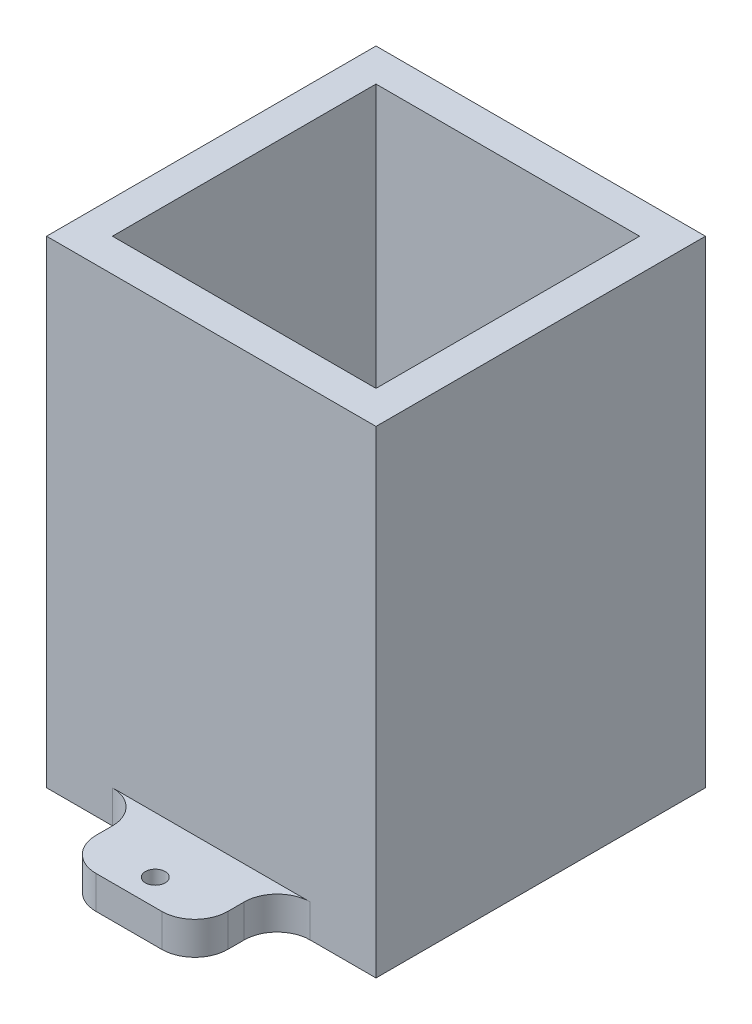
ISO-10303-21;
HEADER;
FILE_DESCRIPTION(('STEP AP214'),'2;1');
FILE_NAME('part.step','',(''),(''),'','','');
FILE_SCHEMA(('AUTOMOTIVE_DESIGN { 1 0 10303 214 1 1 1 1 }'));
ENDSEC;
DATA;
#1=APPLICATION_CONTEXT('core data for automotive mechanical design processes');
#2=APPLICATION_PROTOCOL_DEFINITION('international standard','automotive_design',2000,#1);
#3=PRODUCT_CONTEXT('',#1,'mechanical');
#4=PRODUCT('Part','Part','',(#3));
#5=PRODUCT_RELATED_PRODUCT_CATEGORY('part','',(#4));
#6=PRODUCT_DEFINITION_FORMATION('','',#4);
#7=PRODUCT_DEFINITION_CONTEXT('part definition',#1,'design');
#8=PRODUCT_DEFINITION('design','',#6,#7);
#9=PRODUCT_DEFINITION_SHAPE('','',#8);
#10=(LENGTH_UNIT() NAMED_UNIT(*) SI_UNIT(.MILLI.,.METRE.));
#11=(NAMED_UNIT(*) PLANE_ANGLE_UNIT() SI_UNIT($,.RADIAN.));
#12=(NAMED_UNIT(*) SI_UNIT($,.STERADIAN.) SOLID_ANGLE_UNIT());
#13=UNCERTAINTY_MEASURE_WITH_UNIT(LENGTH_MEASURE(1.E-05),#10,'distance_accuracy_value','');
#14=(GEOMETRIC_REPRESENTATION_CONTEXT(3) GLOBAL_UNCERTAINTY_ASSIGNED_CONTEXT((#13)) GLOBAL_UNIT_ASSIGNED_CONTEXT((#10,
#11,#12)) REPRESENTATION_CONTEXT('',''));
#15=CARTESIAN_POINT('',(0.,0.,0.));
#16=DIRECTION('',(0.,0.,1.));
#17=DIRECTION('',(1.,0.,0.));
#18=AXIS2_PLACEMENT_3D('',#15,#16,#17);
#19=CARTESIAN_POINT('',(-50.,140.,-50.));
#20=DIRECTION('',(0.,0.,1.));
#21=DIRECTION('',(1.,0.,0.));
#22=AXIS2_PLACEMENT_3D('',#19,#20,#21);
#23=PLANE('',#22);
#24=DIRECTION('',(-1.,0.,0.));
#25=VECTOR('',#24,1.);
#26=CARTESIAN_POINT('',(-20.,5.,-50.));
#27=LINE('',#26,#25);
#28=CARTESIAN_POINT('',(30.,5.,-50.));
#29=VERTEX_POINT('',#28);
#30=CARTESIAN_POINT('',(-30.,5.,-50.));
#31=VERTEX_POINT('',#30);
#32=EDGE_CURVE('E719',#29,#31,#27,.T.);
#33=ORIENTED_EDGE('',*,*,#32,.T.);
#34=DIRECTION('',(0.,-1.,0.));
#35=VECTOR('',#34,1.);
#36=CARTESIAN_POINT('',(-30.,140.,-50.));
#37=LINE('',#36,#35);
#38=CARTESIAN_POINT('',(-30.,-5.,-50.));
#39=VERTEX_POINT('',#38);
#40=EDGE_CURVE('E212',#31,#39,#37,.T.);
#41=ORIENTED_EDGE('',*,*,#40,.T.);
#42=DIRECTION('',(1.,0.,0.));
#43=VECTOR('',#42,1.);
#44=CARTESIAN_POINT('',(-50.,-5.,-50.));
#45=LINE('',#44,#43);
#46=CARTESIAN_POINT('',(-50.,-5.,-50.));
#47=VERTEX_POINT('',#46);
#48=EDGE_CURVE('E210',#47,#39,#45,.T.);
#49=ORIENTED_EDGE('',*,*,#48,.F.);
#50=DIRECTION('',(0.,-1.,0.));
#51=VECTOR('',#50,1.);
#52=CARTESIAN_POINT('',(-50.,140.,-50.));
#53=LINE('',#52,#51);
#54=CARTESIAN_POINT('',(-50.,140.,-50.));
#55=VERTEX_POINT('',#54);
#56=EDGE_CURVE('E197',#55,#47,#53,.T.);
#57=ORIENTED_EDGE('',*,*,#56,.F.);
#58=DIRECTION('',(-1.,0.,0.));
#59=VECTOR('',#58,1.);
#60=CARTESIAN_POINT('',(-50.,140.,-50.));
#61=LINE('',#60,#59);
#62=CARTESIAN_POINT('',(50.,140.,-50.));
#63=VERTEX_POINT('',#62);
#64=EDGE_CURVE('E270',#63,#55,#61,.T.);
#65=ORIENTED_EDGE('',*,*,#64,.F.);
#66=DIRECTION('',(0.,-1.,0.));
#67=VECTOR('',#66,1.);
#68=CARTESIAN_POINT('',(50.,140.,-50.));
#69=LINE('',#68,#67);
#70=CARTESIAN_POINT('',(50.,-5.,-50.));
#71=VERTEX_POINT('',#70);
#72=EDGE_CURVE('E205',#63,#71,#69,.T.);
#73=ORIENTED_EDGE('',*,*,#72,.T.);
#74=CARTESIAN_POINT('',(30.,-5.,-50.));
#75=VERTEX_POINT('',#74);
#76=EDGE_CURVE('E215',#75,#71,#45,.T.);
#77=ORIENTED_EDGE('',*,*,#76,.F.);
#78=DIRECTION('',(0.,-1.,0.));
#79=VECTOR('',#78,1.);
#80=CARTESIAN_POINT('',(30.,140.,-50.));
#81=LINE('',#80,#79);
#82=EDGE_CURVE('E280',#75,#29,#81,.F.);
#83=ORIENTED_EDGE('',*,*,#82,.T.);
#84=EDGE_LOOP('',(#33,#41,#49,#57,#65,#73,#77,#83));
#85=FACE_BOUND('',#84,.T.);
#86=ADVANCED_FACE('F34',(#85),#23,.F.);
#87=CARTESIAN_POINT('',(-50.,140.,50.));
#88=DIRECTION('',(0.,0.,-1.));
#89=DIRECTION('',(-1.,0.,0.));
#90=AXIS2_PLACEMENT_3D('',#87,#88,#89);
#91=PLANE('',#90);
#92=DIRECTION('',(1.,0.,0.));
#93=VECTOR('',#92,1.);
#94=CARTESIAN_POINT('',(-20.,5.,50.));
#95=LINE('',#94,#93);
#96=CARTESIAN_POINT('',(-30.,5.,50.));
#97=VERTEX_POINT('',#96);
#98=CARTESIAN_POINT('',(30.,5.,50.));
#99=VERTEX_POINT('',#98);
#100=EDGE_CURVE('E361',#97,#99,#95,.T.);
#101=ORIENTED_EDGE('',*,*,#100,.T.);
#102=DIRECTION('',(0.,-1.,0.));
#103=VECTOR('',#102,1.);
#104=CARTESIAN_POINT('',(30.,140.,50.));
#105=LINE('',#104,#103);
#106=CARTESIAN_POINT('',(30.,-5.,50.));
#107=VERTEX_POINT('',#106);
#108=EDGE_CURVE('E314',#99,#107,#105,.T.);
#109=ORIENTED_EDGE('',*,*,#108,.T.);
#110=DIRECTION('',(-1.,0.,0.));
#111=VECTOR('',#110,1.);
#112=CARTESIAN_POINT('',(-50.,-5.,50.));
#113=LINE('',#112,#111);
#114=CARTESIAN_POINT('',(50.,-5.,50.));
#115=VERTEX_POINT('',#114);
#116=EDGE_CURVE('E232',#115,#107,#113,.T.);
#117=ORIENTED_EDGE('',*,*,#116,.F.);
#118=DIRECTION('',(0.,-1.,0.));
#119=VECTOR('',#118,1.);
#120=CARTESIAN_POINT('',(50.,140.,50.));
#121=LINE('',#120,#119);
#122=CARTESIAN_POINT('',(50.,140.,50.));
#123=VERTEX_POINT('',#122);
#124=EDGE_CURVE('E275',#123,#115,#121,.T.);
#125=ORIENTED_EDGE('',*,*,#124,.F.);
#126=DIRECTION('',(1.,0.,0.));
#127=VECTOR('',#126,1.);
#128=CARTESIAN_POINT('',(-50.,140.,50.));
#129=LINE('',#128,#127);
#130=CARTESIAN_POINT('',(-50.,140.,50.));
#131=VERTEX_POINT('',#130);
#132=EDGE_CURVE('E273',#131,#123,#129,.T.);
#133=ORIENTED_EDGE('',*,*,#132,.F.);
#134=DIRECTION('',(0.,-1.,0.));
#135=VECTOR('',#134,1.);
#136=CARTESIAN_POINT('',(-50.,140.,50.));
#137=LINE('',#136,#135);
#138=CARTESIAN_POINT('',(-50.,-5.,50.));
#139=VERTEX_POINT('',#138);
#140=EDGE_CURVE('E206',#131,#139,#137,.T.);
#141=ORIENTED_EDGE('',*,*,#140,.T.);
#142=CARTESIAN_POINT('',(-30.,-5.,50.));
#143=VERTEX_POINT('',#142);
#144=EDGE_CURVE('E221',#143,#139,#113,.T.);
#145=ORIENTED_EDGE('',*,*,#144,.F.);
#146=DIRECTION('',(0.,-1.,0.));
#147=VECTOR('',#146,1.);
#148=CARTESIAN_POINT('',(-30.,140.,50.));
#149=LINE('',#148,#147);
#150=EDGE_CURVE('E311',#143,#97,#149,.F.);
#151=ORIENTED_EDGE('',*,*,#150,.T.);
#152=EDGE_LOOP('',(#101,#109,#117,#125,#133,#141,#145,#151));
#153=FACE_BOUND('',#152,.T.);
#154=ADVANCED_FACE('F354',(#153),#91,.F.);
#155=CARTESIAN_POINT('',(0.,140.,0.));
#156=DIRECTION('',(0.,-1.,0.));
#157=DIRECTION('',(0.,0.,-1.));
#158=AXIS2_PLACEMENT_3D('',#155,#156,#157);
#159=PLANE('',#158);
#160=DIRECTION('',(0.,0.,-1.));
#161=VECTOR('',#160,1.);
#162=CARTESIAN_POINT('',(50.,140.,50.));
#163=LINE('',#162,#161);
#164=EDGE_CURVE('E267',#123,#63,#163,.T.);
#165=ORIENTED_EDGE('',*,*,#164,.T.);
#166=ORIENTED_EDGE('',*,*,#64,.T.);
#167=DIRECTION('',(0.,0.,1.));
#168=VECTOR('',#167,1.);
#169=CARTESIAN_POINT('',(-50.,140.,50.));
#170=LINE('',#169,#168);
#171=EDGE_CURVE('E203',#55,#131,#170,.T.);
#172=ORIENTED_EDGE('',*,*,#171,.T.);
#173=ORIENTED_EDGE('',*,*,#132,.T.);
#174=EDGE_LOOP('',(#165,#166,#172,#173));
#175=FACE_BOUND('',#174,.T.);
#176=DIRECTION('',(0.,0.,1.));
#177=VECTOR('',#176,1.);
#178=CARTESIAN_POINT('',(-40.,140.,40.));
#179=LINE('',#178,#177);
#180=CARTESIAN_POINT('',(-40.,140.,-40.));
#181=VERTEX_POINT('',#180);
#182=CARTESIAN_POINT('',(-40.,140.,40.));
#183=VERTEX_POINT('',#182);
#184=EDGE_CURVE('E236',#181,#183,#179,.T.);
#185=ORIENTED_EDGE('',*,*,#184,.F.);
#186=DIRECTION('',(-1.,0.,0.));
#187=VECTOR('',#186,1.);
#188=CARTESIAN_POINT('',(-40.,140.,-40.));
#189=LINE('',#188,#187);
#190=CARTESIAN_POINT('',(40.,140.,-40.));
#191=VERTEX_POINT('',#190);
#192=EDGE_CURVE('E244',#191,#181,#189,.T.);
#193=ORIENTED_EDGE('',*,*,#192,.F.);
#194=DIRECTION('',(0.,0.,-1.));
#195=VECTOR('',#194,1.);
#196=CARTESIAN_POINT('',(40.,140.,40.));
#197=LINE('',#196,#195);
#198=CARTESIAN_POINT('',(40.,140.,40.));
#199=VERTEX_POINT('',#198);
#200=EDGE_CURVE('E241',#199,#191,#197,.T.);
#201=ORIENTED_EDGE('',*,*,#200,.F.);
#202=DIRECTION('',(1.,0.,0.));
#203=VECTOR('',#202,1.);
#204=CARTESIAN_POINT('',(-40.,140.,40.));
#205=LINE('',#204,#203);
#206=EDGE_CURVE('E238',#183,#199,#205,.T.);
#207=ORIENTED_EDGE('',*,*,#206,.F.);
#208=EDGE_LOOP('',(#185,#193,#201,#207));
#209=FACE_BOUND('',#208,.T.);
#210=ADVANCED_FACE('F408',(#175,#209),#159,.F.);
#211=CARTESIAN_POINT('',(50.,140.,50.));
#212=DIRECTION('',(-1.,0.,0.));
#213=DIRECTION('',(0.,0.,1.));
#214=AXIS2_PLACEMENT_3D('',#211,#212,#213);
#215=PLANE('',#214);
#216=ORIENTED_EDGE('',*,*,#124,.T.);
#217=DIRECTION('',(0.,0.,1.));
#218=VECTOR('',#217,1.);
#219=CARTESIAN_POINT('',(50.,-5.,-50.));
#220=LINE('',#219,#218);
#221=EDGE_CURVE('E214',#71,#115,#220,.T.);
#222=ORIENTED_EDGE('',*,*,#221,.F.);
#223=ORIENTED_EDGE('',*,*,#72,.F.);
#224=ORIENTED_EDGE('',*,*,#164,.F.);
#225=EDGE_LOOP('',(#216,#222,#223,#224));
#226=FACE_BOUND('',#225,.T.);
#227=ADVANCED_FACE('F412',(#226),#215,.F.);
#228=CARTESIAN_POINT('',(-50.,140.,50.));
#229=DIRECTION('',(1.,0.,0.));
#230=DIRECTION('',(0.,0.,-1.));
#231=AXIS2_PLACEMENT_3D('',#228,#229,#230);
#232=PLANE('',#231);
#233=ORIENTED_EDGE('',*,*,#56,.T.);
#234=DIRECTION('',(0.,0.,-1.));
#235=VECTOR('',#234,1.);
#236=CARTESIAN_POINT('',(-50.,-5.,-50.));
#237=LINE('',#236,#235);
#238=EDGE_CURVE('E202',#139,#47,#237,.T.);
#239=ORIENTED_EDGE('',*,*,#238,.F.);
#240=ORIENTED_EDGE('',*,*,#140,.F.);
#241=ORIENTED_EDGE('',*,*,#171,.F.);
#242=EDGE_LOOP('',(#233,#239,#240,#241));
#243=FACE_BOUND('',#242,.T.);
#244=ADVANCED_FACE('F199',(#243),#232,.F.);
#245=CARTESIAN_POINT('',(-40.,140.,40.));
#246=DIRECTION('',(1.,0.,0.));
#247=DIRECTION('',(0.,0.,-1.));
#248=AXIS2_PLACEMENT_3D('',#245,#246,#247);
#249=PLANE('',#248);
#250=DIRECTION('',(0.,0.,1.));
#251=VECTOR('',#250,1.);
#252=CARTESIAN_POINT('',(-40.,0.,40.));
#253=LINE('',#252,#251);
#254=CARTESIAN_POINT('',(-40.,0.,-40.));
#255=VERTEX_POINT('',#254);
#256=CARTESIAN_POINT('',(-40.,0.,40.));
#257=VERTEX_POINT('',#256);
#258=EDGE_CURVE('E235',#255,#257,#253,.T.);
#259=ORIENTED_EDGE('',*,*,#258,.F.);
#260=DIRECTION('',(0.,-1.,0.));
#261=VECTOR('',#260,1.);
#262=CARTESIAN_POINT('',(-40.,140.,-40.));
#263=LINE('',#262,#261);
#264=EDGE_CURVE('E246',#181,#255,#263,.T.);
#265=ORIENTED_EDGE('',*,*,#264,.F.);
#266=ORIENTED_EDGE('',*,*,#184,.T.);
#267=DIRECTION('',(0.,-1.,0.));
#268=VECTOR('',#267,1.);
#269=CARTESIAN_POINT('',(-40.,140.,40.));
#270=LINE('',#269,#268);
#271=EDGE_CURVE('E264',#183,#257,#270,.T.);
#272=ORIENTED_EDGE('',*,*,#271,.T.);
#273=EDGE_LOOP('',(#259,#265,#266,#272));
#274=FACE_BOUND('',#273,.T.);
#275=ADVANCED_FACE('F608',(#274),#249,.T.);
#276=CARTESIAN_POINT('',(-40.,140.,40.));
#277=DIRECTION('',(0.,0.,-1.));
#278=DIRECTION('',(-1.,0.,0.));
#279=AXIS2_PLACEMENT_3D('',#276,#277,#278);
#280=PLANE('',#279);
#281=DIRECTION('',(1.,0.,0.));
#282=VECTOR('',#281,1.);
#283=CARTESIAN_POINT('',(-40.,0.,40.));
#284=LINE('',#283,#282);
#285=CARTESIAN_POINT('',(40.,0.,40.));
#286=VERTEX_POINT('',#285);
#287=EDGE_CURVE('E249',#257,#286,#284,.T.);
#288=ORIENTED_EDGE('',*,*,#287,.F.);
#289=ORIENTED_EDGE('',*,*,#271,.F.);
#290=ORIENTED_EDGE('',*,*,#206,.T.);
#291=DIRECTION('',(0.,-1.,0.));
#292=VECTOR('',#291,1.);
#293=CARTESIAN_POINT('',(40.,140.,40.));
#294=LINE('',#293,#292);
#295=EDGE_CURVE('E262',#199,#286,#294,.T.);
#296=ORIENTED_EDGE('',*,*,#295,.T.);
#297=EDGE_LOOP('',(#288,#289,#290,#296));
#298=FACE_BOUND('',#297,.T.);
#299=ADVANCED_FACE('F614',(#298),#280,.T.);
#300=CARTESIAN_POINT('',(40.,140.,40.));
#301=DIRECTION('',(-1.,0.,0.));
#302=DIRECTION('',(0.,0.,1.));
#303=AXIS2_PLACEMENT_3D('',#300,#301,#302);
#304=PLANE('',#303);
#305=DIRECTION('',(0.,0.,-1.));
#306=VECTOR('',#305,1.);
#307=CARTESIAN_POINT('',(40.,0.,40.));
#308=LINE('',#307,#306);
#309=CARTESIAN_POINT('',(40.,0.,-40.));
#310=VERTEX_POINT('',#309);
#311=EDGE_CURVE('E252',#286,#310,#308,.T.);
#312=ORIENTED_EDGE('',*,*,#311,.F.);
#313=ORIENTED_EDGE('',*,*,#295,.F.);
#314=ORIENTED_EDGE('',*,*,#200,.T.);
#315=DIRECTION('',(0.,-1.,0.));
#316=VECTOR('',#315,1.);
#317=CARTESIAN_POINT('',(40.,140.,-40.));
#318=LINE('',#317,#316);
#319=EDGE_CURVE('E259',#191,#310,#318,.T.);
#320=ORIENTED_EDGE('',*,*,#319,.T.);
#321=EDGE_LOOP('',(#312,#313,#314,#320));
#322=FACE_BOUND('',#321,.T.);
#323=ADVANCED_FACE('F622',(#322),#304,.T.);
#324=CARTESIAN_POINT('',(-40.,140.,-40.));
#325=DIRECTION('',(0.,0.,1.));
#326=DIRECTION('',(1.,0.,0.));
#327=AXIS2_PLACEMENT_3D('',#324,#325,#326);
#328=PLANE('',#327);
#329=DIRECTION('',(-1.,0.,0.));
#330=VECTOR('',#329,1.);
#331=CARTESIAN_POINT('',(-40.,0.,-40.));
#332=LINE('',#331,#330);
#333=EDGE_CURVE('E239',#310,#255,#332,.T.);
#334=ORIENTED_EDGE('',*,*,#333,.F.);
#335=ORIENTED_EDGE('',*,*,#319,.F.);
#336=ORIENTED_EDGE('',*,*,#192,.T.);
#337=ORIENTED_EDGE('',*,*,#264,.T.);
#338=EDGE_LOOP('',(#334,#335,#336,#337));
#339=FACE_BOUND('',#338,.T.);
#340=ADVANCED_FACE('F569',(#339),#328,.T.);
#341=CARTESIAN_POINT('',(0.,-5.,0.));
#342=DIRECTION('',(0.,1.,0.));
#343=DIRECTION('',(0.,0.,1.));
#344=AXIS2_PLACEMENT_3D('',#341,#342,#343);
#345=PLANE('',#344);
#346=CARTESIAN_POINT('',(0.,-5.,-67.));
#347=DIRECTION('',(0.,1.,0.));
#348=DIRECTION('',(0.,0.,1.));
#349=AXIS2_PLACEMENT_3D('',#346,#347,#348);
#350=CIRCLE('',#349,3.);
#351=CARTESIAN_POINT('',(0.,-5.,-64.));
#352=VERTEX_POINT('',#351);
#353=EDGE_CURVE('E732',#352,#352,#350,.T.);
#354=ORIENTED_EDGE('',*,*,#353,.T.);
#355=EDGE_LOOP('',(#354));
#356=FACE_BOUND('',#355,.T.);
#357=CARTESIAN_POINT('',(0.,-5.,67.));
#358=DIRECTION('',(0.,1.,0.));
#359=DIRECTION('',(0.,0.,-1.));
#360=AXIS2_PLACEMENT_3D('',#357,#358,#359);
#361=CIRCLE('',#360,3.);
#362=CARTESIAN_POINT('',(0.,-5.,64.));
#363=VERTEX_POINT('',#362);
#364=EDGE_CURVE('E741',#363,#363,#361,.T.);
#365=ORIENTED_EDGE('',*,*,#364,.T.);
#366=EDGE_LOOP('',(#365));
#367=FACE_BOUND('',#366,.T.);
#368=DIRECTION('',(0.,0.,-1.));
#369=VECTOR('',#368,1.);
#370=CARTESIAN_POINT('',(-20.,-5.,-50.));
#371=LINE('',#370,#369);
#372=CARTESIAN_POINT('',(-20.,-5.,-60.));
#373=VERTEX_POINT('',#372);
#374=CARTESIAN_POINT('',(-20.,-5.,-65.));
#375=VERTEX_POINT('',#374);
#376=EDGE_CURVE('E730',#373,#375,#371,.T.);
#377=ORIENTED_EDGE('',*,*,#376,.T.);
#378=CARTESIAN_POINT('',(-10.,-5.,-65.));
#379=DIRECTION('',(0.,1.,0.));
#380=DIRECTION('',(0.,0.,1.));
#381=AXIS2_PLACEMENT_3D('',#378,#379,#380);
#382=CIRCLE('',#381,10.);
#383=CARTESIAN_POINT('',(-10.,-5.,-75.));
#384=VERTEX_POINT('',#383);
#385=EDGE_CURVE('E300',#375,#384,#382,.F.);
#386=ORIENTED_EDGE('',*,*,#385,.T.);
#387=DIRECTION('',(1.,0.,0.));
#388=VECTOR('',#387,1.);
#389=CARTESIAN_POINT('',(-20.,-5.,-75.));
#390=LINE('',#389,#388);
#391=CARTESIAN_POINT('',(10.,-5.,-75.));
#392=VERTEX_POINT('',#391);
#393=EDGE_CURVE('E731',#384,#392,#390,.T.);
#394=ORIENTED_EDGE('',*,*,#393,.T.);
#395=CARTESIAN_POINT('',(10.,-5.,-65.));
#396=DIRECTION('',(0.,1.,0.));
#397=DIRECTION('',(0.,0.,1.));
#398=AXIS2_PLACEMENT_3D('',#395,#396,#397);
#399=CIRCLE('',#398,10.);
#400=CARTESIAN_POINT('',(20.,-5.,-65.));
#401=VERTEX_POINT('',#400);
#402=EDGE_CURVE('E298',#392,#401,#399,.F.);
#403=ORIENTED_EDGE('',*,*,#402,.T.);
#404=DIRECTION('',(0.,0.,1.));
#405=VECTOR('',#404,1.);
#406=CARTESIAN_POINT('',(20.,-5.,-50.));
#407=LINE('',#406,#405);
#408=CARTESIAN_POINT('',(20.,-5.,-60.));
#409=VERTEX_POINT('',#408);
#410=EDGE_CURVE('E373',#401,#409,#407,.T.);
#411=ORIENTED_EDGE('',*,*,#410,.T.);
#412=CARTESIAN_POINT('',(30.,-5.,-60.));
#413=DIRECTION('',(0.,1.,0.));
#414=DIRECTION('',(0.,0.,1.));
#415=AXIS2_PLACEMENT_3D('',#412,#413,#414);
#416=CIRCLE('',#415,10.);
#417=EDGE_CURVE('E339',#409,#75,#416,.T.);
#418=ORIENTED_EDGE('',*,*,#417,.T.);
#419=ORIENTED_EDGE('',*,*,#76,.T.);
#420=ORIENTED_EDGE('',*,*,#221,.T.);
#421=ORIENTED_EDGE('',*,*,#116,.T.);
#422=CARTESIAN_POINT('',(30.,-5.,60.));
#423=DIRECTION('',(0.,1.,0.));
#424=DIRECTION('',(0.,0.,1.));
#425=AXIS2_PLACEMENT_3D('',#422,#423,#424);
#426=CIRCLE('',#425,10.);
#427=CARTESIAN_POINT('',(20.,-5.,60.));
#428=VERTEX_POINT('',#427);
#429=EDGE_CURVE('E343',#107,#428,#426,.T.);
#430=ORIENTED_EDGE('',*,*,#429,.T.);
#431=DIRECTION('',(0.,0.,1.));
#432=VECTOR('',#431,1.);
#433=CARTESIAN_POINT('',(20.,-5.,50.));
#434=LINE('',#433,#432);
#435=CARTESIAN_POINT('',(20.,-5.,65.));
#436=VERTEX_POINT('',#435);
#437=EDGE_CURVE('E370',#428,#436,#434,.T.);
#438=ORIENTED_EDGE('',*,*,#437,.T.);
#439=CARTESIAN_POINT('',(10.,-5.,65.));
#440=DIRECTION('',(0.,1.,0.));
#441=DIRECTION('',(0.,0.,1.));
#442=AXIS2_PLACEMENT_3D('',#439,#440,#441);
#443=CIRCLE('',#442,10.);
#444=CARTESIAN_POINT('',(10.,-5.,75.));
#445=VERTEX_POINT('',#444);
#446=EDGE_CURVE('E296',#436,#445,#443,.F.);
#447=ORIENTED_EDGE('',*,*,#446,.T.);
#448=DIRECTION('',(-1.,0.,0.));
#449=VECTOR('',#448,1.);
#450=CARTESIAN_POINT('',(-20.,-5.,75.));
#451=LINE('',#450,#449);
#452=CARTESIAN_POINT('',(-10.,-5.,75.));
#453=VERTEX_POINT('',#452);
#454=EDGE_CURVE('E365',#445,#453,#451,.T.);
#455=ORIENTED_EDGE('',*,*,#454,.T.);
#456=CARTESIAN_POINT('',(-10.,-5.,65.));
#457=DIRECTION('',(0.,1.,0.));
#458=DIRECTION('',(0.,0.,1.));
#459=AXIS2_PLACEMENT_3D('',#456,#457,#458);
#460=CIRCLE('',#459,10.);
#461=CARTESIAN_POINT('',(-20.,-5.,65.));
#462=VERTEX_POINT('',#461);
#463=EDGE_CURVE('E294',#453,#462,#460,.F.);
#464=ORIENTED_EDGE('',*,*,#463,.T.);
#465=DIRECTION('',(0.,0.,-1.));
#466=VECTOR('',#465,1.);
#467=CARTESIAN_POINT('',(-20.,-5.,50.));
#468=LINE('',#467,#466);
#469=CARTESIAN_POINT('',(-20.,-5.,60.));
#470=VERTEX_POINT('',#469);
#471=EDGE_CURVE('E349',#462,#470,#468,.T.);
#472=ORIENTED_EDGE('',*,*,#471,.T.);
#473=CARTESIAN_POINT('',(-30.,-5.,60.));
#474=DIRECTION('',(0.,1.,0.));
#475=DIRECTION('',(0.,0.,1.));
#476=AXIS2_PLACEMENT_3D('',#473,#474,#475);
#477=CIRCLE('',#476,10.);
#478=EDGE_CURVE('E42',#470,#143,#477,.T.);
#479=ORIENTED_EDGE('',*,*,#478,.T.);
#480=ORIENTED_EDGE('',*,*,#144,.T.);
#481=ORIENTED_EDGE('',*,*,#238,.T.);
#482=ORIENTED_EDGE('',*,*,#48,.T.);
#483=CARTESIAN_POINT('',(-30.,-5.,-60.));
#484=DIRECTION('',(0.,1.,0.));
#485=DIRECTION('',(0.,0.,1.));
#486=AXIS2_PLACEMENT_3D('',#483,#484,#485);
#487=CIRCLE('',#486,10.);
#488=EDGE_CURVE('E334',#39,#373,#487,.T.);
#489=ORIENTED_EDGE('',*,*,#488,.T.);
#490=EDGE_LOOP('',(#377,#386,#394,#403,#411,#418,#419,#420,#421,#430,#438,#447,#455,#464,#472,
#479,#480,#481,#482,#489));
#491=FACE_BOUND('',#490,.T.);
#492=CARTESIAN_POINT('',(0.,-5.,0.));
#493=DIRECTION('',(0.,-1.,0.));
#494=DIRECTION('',(0.,0.,-1.));
#495=AXIS2_PLACEMENT_3D('',#492,#493,#494);
#496=CIRCLE('',#495,25.);
#497=CARTESIAN_POINT('',(0.,-5.,-25.));
#498=VERTEX_POINT('',#497);
#499=EDGE_CURVE('E223',#498,#498,#496,.T.);
#500=ORIENTED_EDGE('',*,*,#499,.F.);
#501=EDGE_LOOP('',(#500));
#502=FACE_BOUND('',#501,.T.);
#503=ADVANCED_FACE('F218',(#356,#367,#491,#502),#345,.F.);
#504=CARTESIAN_POINT('',(0.,0.,0.));
#505=DIRECTION('',(0.,1.,0.));
#506=DIRECTION('',(0.,0.,1.));
#507=AXIS2_PLACEMENT_3D('',#504,#505,#506);
#508=PLANE('',#507);
#509=ORIENTED_EDGE('',*,*,#311,.T.);
#510=ORIENTED_EDGE('',*,*,#333,.T.);
#511=ORIENTED_EDGE('',*,*,#258,.T.);
#512=ORIENTED_EDGE('',*,*,#287,.T.);
#513=EDGE_LOOP('',(#509,#510,#511,#512));
#514=FACE_BOUND('',#513,.T.);
#515=CARTESIAN_POINT('',(0.,0.,0.));
#516=DIRECTION('',(0.,-1.,0.));
#517=DIRECTION('',(0.,0.,-1.));
#518=AXIS2_PLACEMENT_3D('',#515,#516,#517);
#519=CIRCLE('',#518,25.);
#520=CARTESIAN_POINT('',(0.,0.,-25.));
#521=VERTEX_POINT('',#520);
#522=EDGE_CURVE('E226',#521,#521,#519,.T.);
#523=ORIENTED_EDGE('',*,*,#522,.T.);
#524=EDGE_LOOP('',(#523));
#525=FACE_BOUND('',#524,.T.);
#526=ADVANCED_FACE('F568',(#514,#525),#508,.T.);
#527=CARTESIAN_POINT('',(0.,-5.,0.));
#528=DIRECTION('',(0.,1.,0.));
#529=DIRECTION('',(0.,0.,1.));
#530=AXIS2_PLACEMENT_3D('',#527,#528,#529);
#531=CYLINDRICAL_SURFACE('',#530,25.);
#532=ORIENTED_EDGE('',*,*,#499,.T.);
#533=EDGE_LOOP('',(#532));
#534=FACE_BOUND('',#533,.T.);
#535=ORIENTED_EDGE('',*,*,#522,.F.);
#536=EDGE_LOOP('',(#535));
#537=FACE_BOUND('',#536,.T.);
#538=ADVANCED_FACE('F560',(#534,#537),#531,.F.);
#539=CARTESIAN_POINT('',(-20.,5.,50.));
#540=DIRECTION('',(-1.,0.,0.));
#541=DIRECTION('',(0.,0.,1.));
#542=AXIS2_PLACEMENT_3D('',#539,#540,#541);
#543=PLANE('',#542);
#544=DIRECTION('',(0.,0.,-1.));
#545=VECTOR('',#544,1.);
#546=CARTESIAN_POINT('',(-20.,5.,50.));
#547=LINE('',#546,#545);
#548=CARTESIAN_POINT('',(-20.,5.,65.));
#549=VERTEX_POINT('',#548);
#550=CARTESIAN_POINT('',(-20.,5.,60.));
#551=VERTEX_POINT('',#550);
#552=EDGE_CURVE('E360',#549,#551,#547,.T.);
#553=ORIENTED_EDGE('',*,*,#552,.T.);
#554=DIRECTION('',(0.,-1.,0.));
#555=VECTOR('',#554,1.);
#556=CARTESIAN_POINT('',(-20.,5.,60.));
#557=LINE('',#556,#555);
#558=EDGE_CURVE('E324',#551,#470,#557,.T.);
#559=ORIENTED_EDGE('',*,*,#558,.T.);
#560=ORIENTED_EDGE('',*,*,#471,.F.);
#561=DIRECTION('',(0.,-1.,0.));
#562=VECTOR('',#561,1.);
#563=CARTESIAN_POINT('',(-20.,5.,65.));
#564=LINE('',#563,#562);
#565=EDGE_CURVE('E322',#462,#549,#564,.F.);
#566=ORIENTED_EDGE('',*,*,#565,.T.);
#567=EDGE_LOOP('',(#553,#559,#560,#566));
#568=FACE_BOUND('',#567,.T.);
#569=ADVANCED_FACE('F363',(#568),#543,.T.);
#570=CARTESIAN_POINT('',(-20.,5.,75.));
#571=DIRECTION('',(0.,0.,1.));
#572=DIRECTION('',(1.,0.,0.));
#573=AXIS2_PLACEMENT_3D('',#570,#571,#572);
#574=PLANE('',#573);
#575=ORIENTED_EDGE('',*,*,#454,.F.);
#576=DIRECTION('',(0.,-1.,0.));
#577=VECTOR('',#576,1.);
#578=CARTESIAN_POINT('',(10.,5.,75.));
#579=LINE('',#578,#577);
#580=CARTESIAN_POINT('',(10.,5.,75.));
#581=VERTEX_POINT('',#580);
#582=EDGE_CURVE('E56',#445,#581,#579,.F.);
#583=ORIENTED_EDGE('',*,*,#582,.T.);
#584=DIRECTION('',(-1.,0.,0.));
#585=VECTOR('',#584,1.);
#586=CARTESIAN_POINT('',(-20.,5.,75.));
#587=LINE('',#586,#585);
#588=CARTESIAN_POINT('',(-10.,5.,75.));
#589=VERTEX_POINT('',#588);
#590=EDGE_CURVE('E378',#581,#589,#587,.T.);
#591=ORIENTED_EDGE('',*,*,#590,.T.);
#592=DIRECTION('',(0.,-1.,0.));
#593=VECTOR('',#592,1.);
#594=CARTESIAN_POINT('',(-10.,5.,75.));
#595=LINE('',#594,#593);
#596=EDGE_CURVE('E327',#589,#453,#595,.T.);
#597=ORIENTED_EDGE('',*,*,#596,.T.);
#598=EDGE_LOOP('',(#575,#583,#591,#597));
#599=FACE_BOUND('',#598,.T.);
#600=ADVANCED_FACE('F545',(#599),#574,.T.);
#601=CARTESIAN_POINT('',(20.,5.,50.));
#602=DIRECTION('',(1.,0.,0.));
#603=DIRECTION('',(0.,0.,-1.));
#604=AXIS2_PLACEMENT_3D('',#601,#602,#603);
#605=PLANE('',#604);
#606=ORIENTED_EDGE('',*,*,#437,.F.);
#607=DIRECTION('',(0.,-1.,0.));
#608=VECTOR('',#607,1.);
#609=CARTESIAN_POINT('',(20.,5.,60.));
#610=LINE('',#609,#608);
#611=CARTESIAN_POINT('',(20.,5.,60.));
#612=VERTEX_POINT('',#611);
#613=EDGE_CURVE('E320',#428,#612,#610,.F.);
#614=ORIENTED_EDGE('',*,*,#613,.T.);
#615=DIRECTION('',(0.,0.,1.));
#616=VECTOR('',#615,1.);
#617=CARTESIAN_POINT('',(20.,5.,50.));
#618=LINE('',#617,#616);
#619=CARTESIAN_POINT('',(20.,5.,65.));
#620=VERTEX_POINT('',#619);
#621=EDGE_CURVE('E367',#612,#620,#618,.T.);
#622=ORIENTED_EDGE('',*,*,#621,.T.);
#623=DIRECTION('',(0.,-1.,0.));
#624=VECTOR('',#623,1.);
#625=CARTESIAN_POINT('',(20.,5.,65.));
#626=LINE('',#625,#624);
#627=EDGE_CURVE('E317',#620,#436,#626,.T.);
#628=ORIENTED_EDGE('',*,*,#627,.T.);
#629=EDGE_LOOP('',(#606,#614,#622,#628));
#630=FACE_BOUND('',#629,.T.);
#631=ADVANCED_FACE('F386',(#630),#605,.T.);
#632=CARTESIAN_POINT('',(0.,5.,0.));
#633=DIRECTION('',(0.,1.,0.));
#634=DIRECTION('',(0.,0.,1.));
#635=AXIS2_PLACEMENT_3D('',#632,#633,#634);
#636=PLANE('',#635);
#637=CARTESIAN_POINT('',(0.,5.,67.));
#638=DIRECTION('',(0.,1.,0.));
#639=DIRECTION('',(0.,0.,-1.));
#640=AXIS2_PLACEMENT_3D('',#637,#638,#639);
#641=CIRCLE('',#640,3.);
#642=CARTESIAN_POINT('',(0.,5.,64.));
#643=VERTEX_POINT('',#642);
#644=EDGE_CURVE('E738',#643,#643,#641,.T.);
#645=ORIENTED_EDGE('',*,*,#644,.F.);
#646=EDGE_LOOP('',(#645));
#647=FACE_BOUND('',#646,.T.);
#648=ORIENTED_EDGE('',*,*,#590,.F.);
#649=CARTESIAN_POINT('',(10.,5.,65.));
#650=DIRECTION('',(0.,1.,0.));
#651=DIRECTION('',(0.,0.,1.));
#652=AXIS2_PLACEMENT_3D('',#649,#650,#651);
#653=CIRCLE('',#652,10.);
#654=EDGE_CURVE('E332',#581,#620,#653,.T.);
#655=ORIENTED_EDGE('',*,*,#654,.T.);
#656=ORIENTED_EDGE('',*,*,#621,.F.);
#657=CARTESIAN_POINT('',(30.,5.,60.));
#658=DIRECTION('',(0.,1.,0.));
#659=DIRECTION('',(0.,0.,1.));
#660=AXIS2_PLACEMENT_3D('',#657,#658,#659);
#661=CIRCLE('',#660,10.);
#662=EDGE_CURVE('E345',#612,#99,#661,.F.);
#663=ORIENTED_EDGE('',*,*,#662,.T.);
#664=ORIENTED_EDGE('',*,*,#100,.F.);
#665=CARTESIAN_POINT('',(-30.,5.,60.));
#666=DIRECTION('',(0.,1.,0.));
#667=DIRECTION('',(0.,0.,1.));
#668=AXIS2_PLACEMENT_3D('',#665,#666,#667);
#669=CIRCLE('',#668,10.);
#670=EDGE_CURVE('E11',#97,#551,#669,.F.);
#671=ORIENTED_EDGE('',*,*,#670,.T.);
#672=ORIENTED_EDGE('',*,*,#552,.F.);
#673=CARTESIAN_POINT('',(-10.,5.,65.));
#674=DIRECTION('',(0.,1.,0.));
#675=DIRECTION('',(0.,0.,1.));
#676=AXIS2_PLACEMENT_3D('',#673,#674,#675);
#677=CIRCLE('',#676,10.);
#678=EDGE_CURVE('E49',#549,#589,#677,.T.);
#679=ORIENTED_EDGE('',*,*,#678,.T.);
#680=EDGE_LOOP('',(#648,#655,#656,#663,#664,#671,#672,#679));
#681=FACE_BOUND('',#680,.T.);
#682=ADVANCED_FACE('F359',(#647,#681),#636,.T.);
#683=CARTESIAN_POINT('',(20.,5.,-50.));
#684=DIRECTION('',(1.,0.,0.));
#685=DIRECTION('',(0.,0.,-1.));
#686=AXIS2_PLACEMENT_3D('',#683,#684,#685);
#687=PLANE('',#686);
#688=DIRECTION('',(0.,0.,1.));
#689=VECTOR('',#688,1.);
#690=CARTESIAN_POINT('',(20.,5.,-50.));
#691=LINE('',#690,#689);
#692=CARTESIAN_POINT('',(20.,5.,-65.));
#693=VERTEX_POINT('',#692);
#694=CARTESIAN_POINT('',(20.,5.,-60.));
#695=VERTEX_POINT('',#694);
#696=EDGE_CURVE('E381',#693,#695,#691,.T.);
#697=ORIENTED_EDGE('',*,*,#696,.T.);
#698=DIRECTION('',(0.,-1.,0.));
#699=VECTOR('',#698,1.);
#700=CARTESIAN_POINT('',(20.,5.,-60.));
#701=LINE('',#700,#699);
#702=EDGE_CURVE('E291',#695,#409,#701,.T.);
#703=ORIENTED_EDGE('',*,*,#702,.T.);
#704=ORIENTED_EDGE('',*,*,#410,.F.);
#705=DIRECTION('',(0.,-1.,0.));
#706=VECTOR('',#705,1.);
#707=CARTESIAN_POINT('',(20.,5.,-65.));
#708=LINE('',#707,#706);
#709=EDGE_CURVE('E289',#401,#693,#708,.F.);
#710=ORIENTED_EDGE('',*,*,#709,.T.);
#711=EDGE_LOOP('',(#697,#703,#704,#710));
#712=FACE_BOUND('',#711,.T.);
#713=ADVANCED_FACE('F520',(#712),#687,.T.);
#714=CARTESIAN_POINT('',(-20.,5.,-75.));
#715=DIRECTION('',(0.,0.,-1.));
#716=DIRECTION('',(-1.,0.,0.));
#717=AXIS2_PLACEMENT_3D('',#714,#715,#716);
#718=PLANE('',#717);
#719=ORIENTED_EDGE('',*,*,#393,.F.);
#720=DIRECTION('',(0.,-1.,0.));
#721=VECTOR('',#720,1.);
#722=CARTESIAN_POINT('',(-10.,5.,-75.));
#723=LINE('',#722,#721);
#724=CARTESIAN_POINT('',(-10.,5.,-75.));
#725=VERTEX_POINT('',#724);
#726=EDGE_CURVE('E305',#384,#725,#723,.F.);
#727=ORIENTED_EDGE('',*,*,#726,.T.);
#728=DIRECTION('',(1.,0.,0.));
#729=VECTOR('',#728,1.);
#730=CARTESIAN_POINT('',(-20.,5.,-75.));
#731=LINE('',#730,#729);
#732=CARTESIAN_POINT('',(10.,5.,-75.));
#733=VERTEX_POINT('',#732);
#734=EDGE_CURVE('E723',#725,#733,#731,.T.);
#735=ORIENTED_EDGE('',*,*,#734,.T.);
#736=DIRECTION('',(0.,-1.,0.));
#737=VECTOR('',#736,1.);
#738=CARTESIAN_POINT('',(10.,5.,-75.));
#739=LINE('',#738,#737);
#740=EDGE_CURVE('E302',#733,#392,#739,.T.);
#741=ORIENTED_EDGE('',*,*,#740,.T.);
#742=EDGE_LOOP('',(#719,#727,#735,#741));
#743=FACE_BOUND('',#742,.T.);
#744=ADVANCED_FACE('F511',(#743),#718,.T.);
#745=CARTESIAN_POINT('',(-20.,5.,-50.));
#746=DIRECTION('',(-1.,0.,0.));
#747=DIRECTION('',(0.,0.,1.));
#748=AXIS2_PLACEMENT_3D('',#745,#746,#747);
#749=PLANE('',#748);
#750=ORIENTED_EDGE('',*,*,#376,.F.);
#751=DIRECTION('',(0.,-1.,0.));
#752=VECTOR('',#751,1.);
#753=CARTESIAN_POINT('',(-20.,5.,-60.));
#754=LINE('',#753,#752);
#755=CARTESIAN_POINT('',(-20.,5.,-60.));
#756=VERTEX_POINT('',#755);
#757=EDGE_CURVE('E287',#373,#756,#754,.F.);
#758=ORIENTED_EDGE('',*,*,#757,.T.);
#759=DIRECTION('',(0.,0.,-1.));
#760=VECTOR('',#759,1.);
#761=CARTESIAN_POINT('',(-20.,5.,-50.));
#762=LINE('',#761,#760);
#763=CARTESIAN_POINT('',(-20.,5.,-65.));
#764=VERTEX_POINT('',#763);
#765=EDGE_CURVE('E726',#756,#764,#762,.T.);
#766=ORIENTED_EDGE('',*,*,#765,.T.);
#767=DIRECTION('',(0.,-1.,0.));
#768=VECTOR('',#767,1.);
#769=CARTESIAN_POINT('',(-20.,5.,-65.));
#770=LINE('',#769,#768);
#771=EDGE_CURVE('E284',#764,#375,#770,.T.);
#772=ORIENTED_EDGE('',*,*,#771,.T.);
#773=EDGE_LOOP('',(#750,#758,#766,#772));
#774=FACE_BOUND('',#773,.T.);
#775=ADVANCED_FACE('F502',(#774),#749,.T.);
#776=CARTESIAN_POINT('',(0.,5.,0.));
#777=DIRECTION('',(0.,1.,0.));
#778=DIRECTION('',(0.,0.,1.));
#779=AXIS2_PLACEMENT_3D('',#776,#777,#778);
#780=PLANE('',#779);
#781=CARTESIAN_POINT('',(0.,5.,-67.));
#782=DIRECTION('',(0.,1.,0.));
#783=DIRECTION('',(0.,0.,1.));
#784=AXIS2_PLACEMENT_3D('',#781,#782,#783);
#785=CIRCLE('',#784,3.);
#786=CARTESIAN_POINT('',(0.,5.,-64.));
#787=VERTEX_POINT('',#786);
#788=EDGE_CURVE('E744',#787,#787,#785,.T.);
#789=ORIENTED_EDGE('',*,*,#788,.F.);
#790=EDGE_LOOP('',(#789));
#791=FACE_BOUND('',#790,.T.);
#792=ORIENTED_EDGE('',*,*,#734,.F.);
#793=CARTESIAN_POINT('',(-10.,5.,-65.));
#794=DIRECTION('',(0.,1.,0.));
#795=DIRECTION('',(0.,0.,1.));
#796=AXIS2_PLACEMENT_3D('',#793,#794,#795);
#797=CIRCLE('',#796,10.);
#798=EDGE_CURVE('E309',#725,#764,#797,.T.);
#799=ORIENTED_EDGE('',*,*,#798,.T.);
#800=ORIENTED_EDGE('',*,*,#765,.F.);
#801=CARTESIAN_POINT('',(-30.,5.,-60.));
#802=DIRECTION('',(0.,1.,0.));
#803=DIRECTION('',(0.,0.,1.));
#804=AXIS2_PLACEMENT_3D('',#801,#802,#803);
#805=CIRCLE('',#804,10.);
#806=EDGE_CURVE('E336',#756,#31,#805,.F.);
#807=ORIENTED_EDGE('',*,*,#806,.T.);
#808=ORIENTED_EDGE('',*,*,#32,.F.);
#809=CARTESIAN_POINT('',(30.,5.,-60.));
#810=DIRECTION('',(0.,1.,0.));
#811=DIRECTION('',(0.,0.,1.));
#812=AXIS2_PLACEMENT_3D('',#809,#810,#811);
#813=CIRCLE('',#812,10.);
#814=EDGE_CURVE('E341',#29,#695,#813,.F.);
#815=ORIENTED_EDGE('',*,*,#814,.T.);
#816=ORIENTED_EDGE('',*,*,#696,.F.);
#817=CARTESIAN_POINT('',(10.,5.,-65.));
#818=DIRECTION('',(0.,1.,0.));
#819=DIRECTION('',(0.,0.,1.));
#820=AXIS2_PLACEMENT_3D('',#817,#818,#819);
#821=CIRCLE('',#820,10.);
#822=EDGE_CURVE('E307',#693,#733,#821,.T.);
#823=ORIENTED_EDGE('',*,*,#822,.T.);
#824=EDGE_LOOP('',(#792,#799,#800,#807,#808,#815,#816,#823));
#825=FACE_BOUND('',#824,.T.);
#826=ADVANCED_FACE('F493',(#791,#825),#780,.T.);
#827=CARTESIAN_POINT('',(0.,-5.,-67.));
#828=DIRECTION('',(0.,1.,0.));
#829=DIRECTION('',(0.,0.,1.));
#830=AXIS2_PLACEMENT_3D('',#827,#828,#829);
#831=CYLINDRICAL_SURFACE('',#830,3.);
#832=ORIENTED_EDGE('',*,*,#353,.F.);
#833=EDGE_LOOP('',(#832));
#834=FACE_BOUND('',#833,.T.);
#835=ORIENTED_EDGE('',*,*,#788,.T.);
#836=EDGE_LOOP('',(#835));
#837=FACE_BOUND('',#836,.T.);
#838=ADVANCED_FACE('F484',(#834,#837),#831,.F.);
#839=CARTESIAN_POINT('',(0.,-5.,67.));
#840=DIRECTION('',(0.,1.,0.));
#841=DIRECTION('',(0.,0.,1.));
#842=AXIS2_PLACEMENT_3D('',#839,#840,#841);
#843=CYLINDRICAL_SURFACE('',#842,3.);
#844=ORIENTED_EDGE('',*,*,#364,.F.);
#845=EDGE_LOOP('',(#844));
#846=FACE_BOUND('',#845,.T.);
#847=ORIENTED_EDGE('',*,*,#644,.T.);
#848=EDGE_LOOP('',(#847));
#849=FACE_BOUND('',#848,.T.);
#850=ADVANCED_FACE('F420',(#846,#849),#843,.F.);
#851=CARTESIAN_POINT('',(-30.,140.,-60.));
#852=DIRECTION('',(0.,-1.,0.));
#853=DIRECTION('',(0.,0.,-1.));
#854=AXIS2_PLACEMENT_3D('',#851,#852,#853);
#855=CYLINDRICAL_SURFACE('',#854,10.);
#856=ORIENTED_EDGE('',*,*,#806,.F.);
#857=ORIENTED_EDGE('',*,*,#757,.F.);
#858=ORIENTED_EDGE('',*,*,#488,.F.);
#859=ORIENTED_EDGE('',*,*,#40,.F.);
#860=EDGE_LOOP('',(#856,#857,#858,#859));
#861=FACE_BOUND('',#860,.T.);
#862=ADVANCED_FACE('F416',(#861),#855,.F.);
#863=CARTESIAN_POINT('',(30.,5.,-60.));
#864=DIRECTION('',(0.,-1.,0.));
#865=DIRECTION('',(0.,0.,-1.));
#866=AXIS2_PLACEMENT_3D('',#863,#864,#865);
#867=CYLINDRICAL_SURFACE('',#866,10.);
#868=ORIENTED_EDGE('',*,*,#814,.F.);
#869=ORIENTED_EDGE('',*,*,#82,.F.);
#870=ORIENTED_EDGE('',*,*,#417,.F.);
#871=ORIENTED_EDGE('',*,*,#702,.F.);
#872=EDGE_LOOP('',(#868,#869,#870,#871));
#873=FACE_BOUND('',#872,.T.);
#874=ADVANCED_FACE('F419',(#873),#867,.F.);
#875=CARTESIAN_POINT('',(-10.,5.,-65.));
#876=DIRECTION('',(0.,-1.,0.));
#877=DIRECTION('',(0.,0.,-1.));
#878=AXIS2_PLACEMENT_3D('',#875,#876,#877);
#879=CYLINDRICAL_SURFACE('',#878,10.);
#880=ORIENTED_EDGE('',*,*,#798,.F.);
#881=ORIENTED_EDGE('',*,*,#726,.F.);
#882=ORIENTED_EDGE('',*,*,#385,.F.);
#883=ORIENTED_EDGE('',*,*,#771,.F.);
#884=EDGE_LOOP('',(#880,#881,#882,#883));
#885=FACE_BOUND('',#884,.T.);
#886=ADVANCED_FACE('F424',(#885),#879,.T.);
#887=CARTESIAN_POINT('',(10.,5.,-65.));
#888=DIRECTION('',(0.,-1.,0.));
#889=DIRECTION('',(0.,0.,-1.));
#890=AXIS2_PLACEMENT_3D('',#887,#888,#889);
#891=CYLINDRICAL_SURFACE('',#890,10.);
#892=ORIENTED_EDGE('',*,*,#822,.F.);
#893=ORIENTED_EDGE('',*,*,#709,.F.);
#894=ORIENTED_EDGE('',*,*,#402,.F.);
#895=ORIENTED_EDGE('',*,*,#740,.F.);
#896=EDGE_LOOP('',(#892,#893,#894,#895));
#897=FACE_BOUND('',#896,.T.);
#898=ADVANCED_FACE('F428',(#897),#891,.T.);
#899=CARTESIAN_POINT('',(30.,140.,60.));
#900=DIRECTION('',(0.,-1.,0.));
#901=DIRECTION('',(0.,0.,-1.));
#902=AXIS2_PLACEMENT_3D('',#899,#900,#901);
#903=CYLINDRICAL_SURFACE('',#902,10.);
#904=ORIENTED_EDGE('',*,*,#662,.F.);
#905=ORIENTED_EDGE('',*,*,#613,.F.);
#906=ORIENTED_EDGE('',*,*,#429,.F.);
#907=ORIENTED_EDGE('',*,*,#108,.F.);
#908=EDGE_LOOP('',(#904,#905,#906,#907));
#909=FACE_BOUND('',#908,.T.);
#910=ADVANCED_FACE('F391',(#909),#903,.F.);
#911=CARTESIAN_POINT('',(-30.,5.,60.));
#912=DIRECTION('',(0.,-1.,0.));
#913=DIRECTION('',(0.,0.,-1.));
#914=AXIS2_PLACEMENT_3D('',#911,#912,#913);
#915=CYLINDRICAL_SURFACE('',#914,10.);
#916=ORIENTED_EDGE('',*,*,#670,.F.);
#917=ORIENTED_EDGE('',*,*,#150,.F.);
#918=ORIENTED_EDGE('',*,*,#478,.F.);
#919=ORIENTED_EDGE('',*,*,#558,.F.);
#920=EDGE_LOOP('',(#916,#917,#918,#919));
#921=FACE_BOUND('',#920,.T.);
#922=ADVANCED_FACE('F357',(#921),#915,.F.);
#923=CARTESIAN_POINT('',(10.,5.,65.));
#924=DIRECTION('',(0.,-1.,0.));
#925=DIRECTION('',(0.,0.,-1.));
#926=AXIS2_PLACEMENT_3D('',#923,#924,#925);
#927=CYLINDRICAL_SURFACE('',#926,10.);
#928=ORIENTED_EDGE('',*,*,#654,.F.);
#929=ORIENTED_EDGE('',*,*,#582,.F.);
#930=ORIENTED_EDGE('',*,*,#446,.F.);
#931=ORIENTED_EDGE('',*,*,#627,.F.);
#932=EDGE_LOOP('',(#928,#929,#930,#931));
#933=FACE_BOUND('',#932,.T.);
#934=ADVANCED_FACE('F395',(#933),#927,.T.);
#935=CARTESIAN_POINT('',(-10.,5.,65.));
#936=DIRECTION('',(0.,-1.,0.));
#937=DIRECTION('',(0.,0.,-1.));
#938=AXIS2_PLACEMENT_3D('',#935,#936,#937);
#939=CYLINDRICAL_SURFACE('',#938,10.);
#940=ORIENTED_EDGE('',*,*,#678,.F.);
#941=ORIENTED_EDGE('',*,*,#565,.F.);
#942=ORIENTED_EDGE('',*,*,#463,.F.);
#943=ORIENTED_EDGE('',*,*,#596,.F.);
#944=EDGE_LOOP('',(#940,#941,#942,#943));
#945=FACE_BOUND('',#944,.T.);
#946=ADVANCED_FACE('F36',(#945),#939,.T.);
#947=CLOSED_SHELL('',(#86,#154,#210,#227,#244,#275,#299,#323,#340,#503,#526,#538,#569,#600,#631,
#682,#713,#744,#775,#826,#838,#850,#862,#874,#886,#898,#910,#922,#934,#946));
#948=MANIFOLD_SOLID_BREP('B2',#947);
#949=ADVANCED_BREP_SHAPE_REPRESENTATION('',(#18,#948),#14);
#950=SHAPE_DEFINITION_REPRESENTATION(#9,#949);
ENDSEC;
END-ISO-10303-21;
